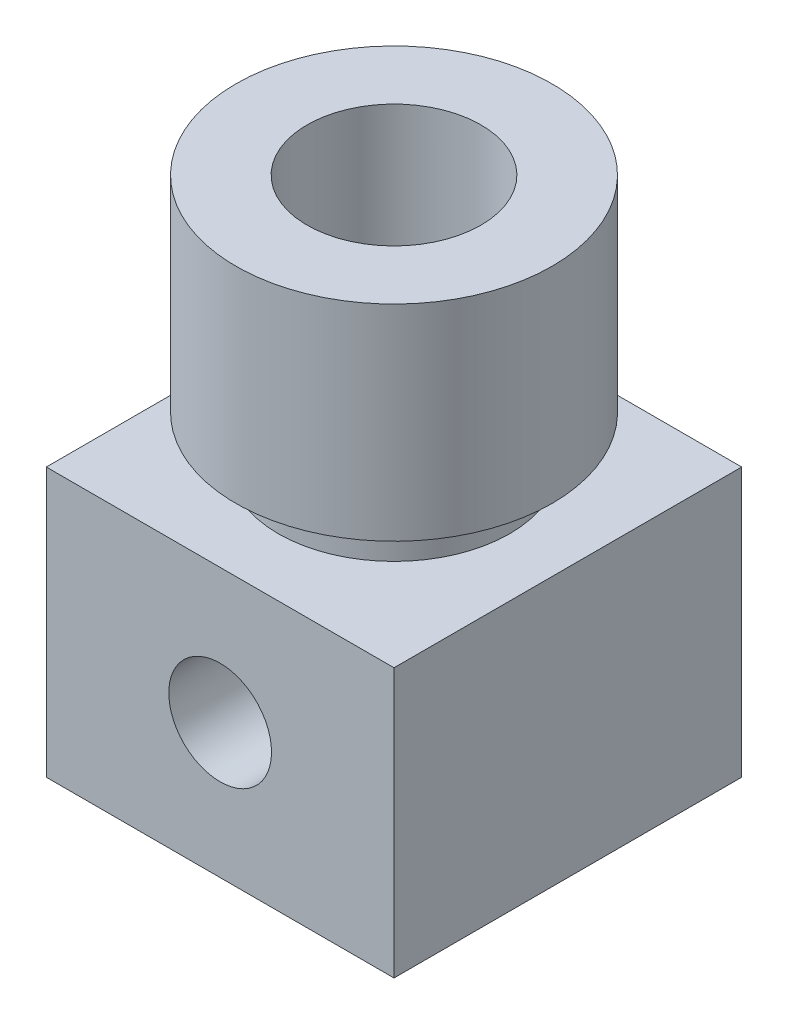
ISO-10303-21;
HEADER;
FILE_DESCRIPTION(('STEP AP214'),'2;1');
FILE_NAME('part.step','',(''),(''),'','','');
FILE_SCHEMA(('AUTOMOTIVE_DESIGN { 1 0 10303 214 1 1 1 1 }'));
ENDSEC;
DATA;
#1=APPLICATION_CONTEXT('core data for automotive mechanical design processes');
#2=APPLICATION_PROTOCOL_DEFINITION('international standard','automotive_design',2000,#1);
#3=PRODUCT_CONTEXT('',#1,'mechanical');
#4=PRODUCT('Part','Part','',(#3));
#5=PRODUCT_RELATED_PRODUCT_CATEGORY('part','',(#4));
#6=PRODUCT_DEFINITION_FORMATION('','',#4);
#7=PRODUCT_DEFINITION_CONTEXT('part definition',#1,'design');
#8=PRODUCT_DEFINITION('design','',#6,#7);
#9=PRODUCT_DEFINITION_SHAPE('','',#8);
#10=(LENGTH_UNIT() NAMED_UNIT(*) SI_UNIT(.MILLI.,.METRE.));
#11=(NAMED_UNIT(*) PLANE_ANGLE_UNIT() SI_UNIT($,.RADIAN.));
#12=(NAMED_UNIT(*) SI_UNIT($,.STERADIAN.) SOLID_ANGLE_UNIT());
#13=UNCERTAINTY_MEASURE_WITH_UNIT(LENGTH_MEASURE(1.E-05),#10,'distance_accuracy_value','');
#14=(GEOMETRIC_REPRESENTATION_CONTEXT(3) GLOBAL_UNCERTAINTY_ASSIGNED_CONTEXT((#13)) GLOBAL_UNIT_ASSIGNED_CONTEXT((#10,
#11,#12)) REPRESENTATION_CONTEXT('',''));
#15=CARTESIAN_POINT('',(0.,0.,0.));
#16=DIRECTION('',(0.,0.,1.));
#17=DIRECTION('',(1.,0.,0.));
#18=AXIS2_PLACEMENT_3D('',#15,#16,#17);
#19=CARTESIAN_POINT('',(0.,17.,0.));
#20=DIRECTION('',(0.,1.,0.));
#21=DIRECTION('',(0.,0.,1.));
#22=AXIS2_PLACEMENT_3D('',#19,#20,#21);
#23=PLANE('',#22);
#24=DIRECTION('',(0.,0.,1.));
#25=VECTOR('',#24,1.);
#26=CARTESIAN_POINT('',(-11.,17.,11.));
#27=LINE('',#26,#25);
#28=CARTESIAN_POINT('',(-11.,17.,-11.));
#29=VERTEX_POINT('',#28);
#30=CARTESIAN_POINT('',(-11.,17.,11.));
#31=VERTEX_POINT('',#30);
#32=EDGE_CURVE('E90',#29,#31,#27,.T.);
#33=ORIENTED_EDGE('',*,*,#32,.T.);
#34=DIRECTION('',(1.,0.,0.));
#35=VECTOR('',#34,1.);
#36=CARTESIAN_POINT('',(11.,17.,11.));
#37=LINE('',#36,#35);
#38=CARTESIAN_POINT('',(11.,17.,11.));
#39=VERTEX_POINT('',#38);
#40=EDGE_CURVE('E85',#31,#39,#37,.T.);
#41=ORIENTED_EDGE('',*,*,#40,.T.);
#42=DIRECTION('',(0.,0.,-1.));
#43=VECTOR('',#42,1.);
#44=CARTESIAN_POINT('',(11.,17.,11.));
#45=LINE('',#44,#43);
#46=CARTESIAN_POINT('',(11.,17.,-11.));
#47=VERTEX_POINT('',#46);
#48=EDGE_CURVE('E88',#39,#47,#45,.T.);
#49=ORIENTED_EDGE('',*,*,#48,.T.);
#50=DIRECTION('',(-1.,0.,0.));
#51=VECTOR('',#50,1.);
#52=CARTESIAN_POINT('',(11.,17.,-11.));
#53=LINE('',#52,#51);
#54=EDGE_CURVE('E55',#47,#29,#53,.T.);
#55=ORIENTED_EDGE('',*,*,#54,.T.);
#56=EDGE_LOOP('',(#33,#41,#49,#55));
#57=FACE_BOUND('',#56,.T.);
#58=CARTESIAN_POINT('',(0.,17.,0.));
#59=DIRECTION('',(0.,-1.,0.));
#60=DIRECTION('',(1.,0.,0.));
#61=AXIS2_PLACEMENT_3D('',#58,#59,#60);
#62=CIRCLE('',#61,7.31805816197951);
#63=CARTESIAN_POINT('',(7.31805816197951,17.,0.));
#64=VERTEX_POINT('',#63);
#65=EDGE_CURVE('E168',#64,#64,#62,.T.);
#66=ORIENTED_EDGE('',*,*,#65,.T.);
#67=EDGE_LOOP('',(#66));
#68=FACE_BOUND('',#67,.T.);
#69=ADVANCED_FACE('F32',(#57,#68),#23,.T.);
#70=CARTESIAN_POINT('',(0.,0.,0.));
#71=DIRECTION('',(0.,1.,0.));
#72=DIRECTION('',(0.,0.,1.));
#73=AXIS2_PLACEMENT_3D('',#70,#71,#72);
#74=PLANE('',#73);
#75=DIRECTION('',(0.,0.,1.));
#76=VECTOR('',#75,1.);
#77=CARTESIAN_POINT('',(-11.,0.,11.));
#78=LINE('',#77,#76);
#79=CARTESIAN_POINT('',(-11.,0.,-11.));
#80=VERTEX_POINT('',#79);
#81=CARTESIAN_POINT('',(-11.,0.,11.));
#82=VERTEX_POINT('',#81);
#83=EDGE_CURVE('E103',#80,#82,#78,.T.);
#84=ORIENTED_EDGE('',*,*,#83,.F.);
#85=DIRECTION('',(-1.,0.,0.));
#86=VECTOR('',#85,1.);
#87=CARTESIAN_POINT('',(11.,0.,-11.));
#88=LINE('',#87,#86);
#89=CARTESIAN_POINT('',(11.,0.,-11.));
#90=VERTEX_POINT('',#89);
#91=EDGE_CURVE('E78',#90,#80,#88,.T.);
#92=ORIENTED_EDGE('',*,*,#91,.F.);
#93=DIRECTION('',(0.,0.,-1.));
#94=VECTOR('',#93,1.);
#95=CARTESIAN_POINT('',(11.,0.,11.));
#96=LINE('',#95,#94);
#97=CARTESIAN_POINT('',(11.,0.,11.));
#98=VERTEX_POINT('',#97);
#99=EDGE_CURVE('E72',#98,#90,#96,.T.);
#100=ORIENTED_EDGE('',*,*,#99,.F.);
#101=DIRECTION('',(1.,0.,0.));
#102=VECTOR('',#101,1.);
#103=CARTESIAN_POINT('',(11.,0.,11.));
#104=LINE('',#103,#102);
#105=EDGE_CURVE('E94',#82,#98,#104,.T.);
#106=ORIENTED_EDGE('',*,*,#105,.F.);
#107=EDGE_LOOP('',(#84,#92,#100,#106));
#108=FACE_BOUND('',#107,.T.);
#109=CARTESIAN_POINT('',(0.,0.,0.));
#110=DIRECTION('',(0.,1.,0.));
#111=DIRECTION('',(0.,0.,1.));
#112=AXIS2_PLACEMENT_3D('',#109,#110,#111);
#113=CIRCLE('',#112,5.5);
#114=CARTESIAN_POINT('',(0.,0.,5.5));
#115=VERTEX_POINT('',#114);
#116=EDGE_CURVE('E106',#115,#115,#113,.T.);
#117=ORIENTED_EDGE('',*,*,#116,.T.);
#118=EDGE_LOOP('',(#117));
#119=FACE_BOUND('',#118,.T.);
#120=ADVANCED_FACE('F146',(#108,#119),#74,.F.);
#121=CARTESIAN_POINT('',(-11.,17.,11.));
#122=DIRECTION('',(1.,0.,0.));
#123=DIRECTION('',(0.,0.,-1.));
#124=AXIS2_PLACEMENT_3D('',#121,#122,#123);
#125=PLANE('',#124);
#126=ORIENTED_EDGE('',*,*,#83,.T.);
#127=DIRECTION('',(0.,-1.,0.));
#128=VECTOR('',#127,1.);
#129=CARTESIAN_POINT('',(-11.,17.,11.));
#130=LINE('',#129,#128);
#131=EDGE_CURVE('E11',#31,#82,#130,.T.);
#132=ORIENTED_EDGE('',*,*,#131,.F.);
#133=ORIENTED_EDGE('',*,*,#32,.F.);
#134=DIRECTION('',(0.,-1.,0.));
#135=VECTOR('',#134,1.);
#136=CARTESIAN_POINT('',(-11.,17.,-11.));
#137=LINE('',#136,#135);
#138=EDGE_CURVE('E99',#29,#80,#137,.T.);
#139=ORIENTED_EDGE('',*,*,#138,.T.);
#140=EDGE_LOOP('',(#126,#132,#133,#139));
#141=FACE_BOUND('',#140,.T.);
#142=ADVANCED_FACE('F34',(#141),#125,.F.);
#143=CARTESIAN_POINT('',(11.,17.,11.));
#144=DIRECTION('',(0.,0.,-1.));
#145=DIRECTION('',(-1.,0.,0.));
#146=AXIS2_PLACEMENT_3D('',#143,#144,#145);
#147=PLANE('',#146);
#148=CARTESIAN_POINT('',(0.,8.5,11.));
#149=DIRECTION('',(0.,0.,1.));
#150=DIRECTION('',(1.,0.,0.));
#151=AXIS2_PLACEMENT_3D('',#148,#149,#150);
#152=CIRCLE('',#151,3.25);
#153=CARTESIAN_POINT('',(3.25,8.5,11.));
#154=VERTEX_POINT('',#153);
#155=EDGE_CURVE('E166',#154,#154,#152,.T.);
#156=ORIENTED_EDGE('',*,*,#155,.F.);
#157=EDGE_LOOP('',(#156));
#158=FACE_BOUND('',#157,.T.);
#159=ORIENTED_EDGE('',*,*,#105,.T.);
#160=DIRECTION('',(0.,-1.,0.));
#161=VECTOR('',#160,1.);
#162=CARTESIAN_POINT('',(11.,17.,11.));
#163=LINE('',#162,#161);
#164=EDGE_CURVE('E46',#39,#98,#163,.T.);
#165=ORIENTED_EDGE('',*,*,#164,.F.);
#166=ORIENTED_EDGE('',*,*,#40,.F.);
#167=ORIENTED_EDGE('',*,*,#131,.T.);
#168=EDGE_LOOP('',(#159,#165,#166,#167));
#169=FACE_BOUND('',#168,.T.);
#170=ADVANCED_FACE('F93',(#158,#169),#147,.F.);
#171=CARTESIAN_POINT('',(11.,17.,11.));
#172=DIRECTION('',(-1.,0.,0.));
#173=DIRECTION('',(0.,0.,1.));
#174=AXIS2_PLACEMENT_3D('',#171,#172,#173);
#175=PLANE('',#174);
#176=ORIENTED_EDGE('',*,*,#99,.T.);
#177=DIRECTION('',(0.,-1.,0.));
#178=VECTOR('',#177,1.);
#179=CARTESIAN_POINT('',(11.,17.,-11.));
#180=LINE('',#179,#178);
#181=EDGE_CURVE('E95',#47,#90,#180,.T.);
#182=ORIENTED_EDGE('',*,*,#181,.F.);
#183=ORIENTED_EDGE('',*,*,#48,.F.);
#184=ORIENTED_EDGE('',*,*,#164,.T.);
#185=EDGE_LOOP('',(#176,#182,#183,#184));
#186=FACE_BOUND('',#185,.T.);
#187=ADVANCED_FACE('F97',(#186),#175,.F.);
#188=CARTESIAN_POINT('',(11.,17.,-11.));
#189=DIRECTION('',(0.,0.,1.));
#190=DIRECTION('',(1.,0.,0.));
#191=AXIS2_PLACEMENT_3D('',#188,#189,#190);
#192=PLANE('',#191);
#193=CARTESIAN_POINT('',(0.,8.5,-11.));
#194=DIRECTION('',(0.,0.,1.));
#195=DIRECTION('',(1.,0.,0.));
#196=AXIS2_PLACEMENT_3D('',#193,#194,#195);
#197=CIRCLE('',#196,3.25);
#198=CARTESIAN_POINT('',(3.25,8.5,-11.));
#199=VERTEX_POINT('',#198);
#200=EDGE_CURVE('E115',#199,#199,#197,.T.);
#201=ORIENTED_EDGE('',*,*,#200,.T.);
#202=EDGE_LOOP('',(#201));
#203=FACE_BOUND('',#202,.T.);
#204=ORIENTED_EDGE('',*,*,#91,.T.);
#205=ORIENTED_EDGE('',*,*,#138,.F.);
#206=ORIENTED_EDGE('',*,*,#54,.F.);
#207=ORIENTED_EDGE('',*,*,#181,.T.);
#208=EDGE_LOOP('',(#204,#205,#206,#207));
#209=FACE_BOUND('',#208,.T.);
#210=ADVANCED_FACE('F153',(#203,#209),#192,.F.);
#211=CARTESIAN_POINT('',(0.,17.,0.));
#212=DIRECTION('',(0.,-1.,0.));
#213=DIRECTION('',(0.,0.,-1.));
#214=AXIS2_PLACEMENT_3D('',#211,#212,#213);
#215=CYLINDRICAL_SURFACE('',#214,5.5);
#216=CARTESIAN_POINT('',(0.,11.75,-5.5));
#217=CARTESIAN_POINT('',(-0.0833686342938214,11.7499993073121,-5.49999936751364));
#218=CARTESIAN_POINT('',(-0.166764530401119,11.7467867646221,-5.49809935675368));
#219=CARTESIAN_POINT('',(-0.33292922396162,11.7339775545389,-5.49054506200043));
#220=CARTESIAN_POINT('',(-0.415697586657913,11.7243768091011,-5.48488837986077));
#221=CARTESIAN_POINT('',(-0.580109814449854,11.6988908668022,-5.46994469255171));
#222=CARTESIAN_POINT('',(-0.661751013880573,11.6829927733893,-5.46065023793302));
#223=CARTESIAN_POINT('',(-0.823156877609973,11.6451229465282,-5.43866389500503));
#224=CARTESIAN_POINT('',(-0.902920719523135,11.6231486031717,-5.42597054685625));
#225=CARTESIAN_POINT('',(-1.13773523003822,11.5487476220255,-5.3833710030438));
#226=CARTESIAN_POINT('',(-1.28931583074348,11.4876830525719,-5.34884832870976));
#227=CARTESIAN_POINT('',(-1.57953818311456,11.3449558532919,-5.27045845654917));
#228=CARTESIAN_POINT('',(-1.71818379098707,11.2632993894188,-5.22659405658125));
#229=CARTESIAN_POINT('',(-1.99051108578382,11.0748393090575,-5.12935536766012));
#230=CARTESIAN_POINT('',(-2.12303609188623,10.9666067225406,-5.07551406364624));
#231=CARTESIAN_POINT('',(-2.36917785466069,10.7312666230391,-4.96540292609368));
#232=CARTESIAN_POINT('',(-2.48277043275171,10.6041353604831,-4.90913010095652));
#233=CARTESIAN_POINT('',(-2.70142042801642,10.3169069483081,-4.7926403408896));
#234=CARTESIAN_POINT('',(-2.8038858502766,10.154689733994,-4.7327423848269));
#235=CARTESIAN_POINT('',(-2.9796948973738,9.81182238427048,-4.62408365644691));
#236=CARTESIAN_POINT('',(-3.05308492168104,9.63120220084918,-4.57530519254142));
#237=CARTESIAN_POINT('',(-3.15356876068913,9.3000074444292,-4.5064184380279));
#238=CARTESIAN_POINT('',(-3.18748949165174,9.1523481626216,-4.48226631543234));
#239=CARTESIAN_POINT('',(-3.23442018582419,8.85217970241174,-4.44852737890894));
#240=CARTESIAN_POINT('',(-3.24745494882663,8.69967649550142,-4.43892329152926));
#241=CARTESIAN_POINT('',(-3.25187121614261,8.39391559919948,-4.43568990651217));
#242=CARTESIAN_POINT('',(-3.24321470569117,8.24065705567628,-4.44208865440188));
#243=CARTESIAN_POINT('',(-3.20470874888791,7.93819547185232,-4.46994159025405));
#244=CARTESIAN_POINT('',(-3.17484378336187,7.78899548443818,-4.49140680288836));
#245=CARTESIAN_POINT('',(-3.09586588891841,7.49980557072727,-4.54619249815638));
#246=CARTESIAN_POINT('',(-3.04694420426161,7.35973979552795,-4.57939489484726));
#247=CARTESIAN_POINT('',(-2.93161593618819,7.08941354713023,-4.6540670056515));
#248=CARTESIAN_POINT('',(-2.86520285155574,6.95915674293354,-4.69553979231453));
#249=CARTESIAN_POINT('',(-2.70372507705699,6.68858270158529,-4.79062113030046));
#250=CARTESIAN_POINT('',(-2.6057073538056,6.55032866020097,-4.8450936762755));
#251=CARTESIAN_POINT('',(-2.38970593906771,6.29084384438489,-4.95520459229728));
#252=CARTESIAN_POINT('',(-2.27170377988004,6.1696290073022,-5.01084399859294));
#253=CARTESIAN_POINT('',(-2.00053312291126,5.9315487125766,-5.12563927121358));
#254=CARTESIAN_POINT('',(-1.84478359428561,5.81732706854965,-5.18430284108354));
#255=CARTESIAN_POINT('',(-1.59598018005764,5.66719851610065,-5.26407557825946));
#256=CARTESIAN_POINT('',(-1.51047637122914,5.62067442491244,-5.28930500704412));
#257=CARTESIAN_POINT('',(-1.33488500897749,5.53519016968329,-5.33632055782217));
#258=CARTESIAN_POINT('',(-1.24480030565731,5.49622537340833,-5.3581087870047));
#259=CARTESIAN_POINT('',(-1.06665933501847,5.42864544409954,-5.3962945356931));
#260=CARTESIAN_POINT('',(-0.978850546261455,5.3995229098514,-5.41295005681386));
#261=CARTESIAN_POINT('',(-0.800477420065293,5.34875796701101,-5.44218660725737));
#262=CARTESIAN_POINT('',(-0.709914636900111,5.32711142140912,-5.45476988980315));
#263=CARTESIAN_POINT('',(-0.526831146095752,5.29163009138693,-5.47548444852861));
#264=CARTESIAN_POINT('',(-0.434311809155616,5.27779001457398,-5.4836187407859));
#265=CARTESIAN_POINT('',(-0.248138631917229,5.25813531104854,-5.49519091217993));
#266=CARTESIAN_POINT('',(-0.154484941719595,5.2523196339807,-5.49862940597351));
#267=CARTESIAN_POINT('',(0.0206896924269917,5.24904580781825,-5.50056379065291));
#268=CARTESIAN_POINT('',(0.102186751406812,5.25058928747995,-5.49965012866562));
#269=CARTESIAN_POINT('',(0.264724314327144,5.25977464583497,-5.49422890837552));
#270=CARTESIAN_POINT('',(0.345764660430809,5.26741851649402,-5.48972017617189));
#271=CARTESIAN_POINT('',(0.587212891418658,5.29938215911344,-5.4709340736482));
#272=CARTESIAN_POINT('',(0.746132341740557,5.33273082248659,-5.4513984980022));
#273=CARTESIAN_POINT('',(1.0522555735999,5.42100565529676,-5.40059701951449));
#274=CARTESIAN_POINT('',(1.19962749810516,5.47549789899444,-5.36956755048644));
#275=CARTESIAN_POINT('',(1.48317090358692,5.60397908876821,-5.29826225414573));
#276=CARTESIAN_POINT('',(1.61934002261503,5.67797213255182,-5.25798448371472));
#277=CARTESIAN_POINT('',(1.89190341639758,5.85197952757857,-5.16657175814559));
#278=CARTESIAN_POINT('',(2.02684330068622,5.95390167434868,-5.11474286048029));
#279=CARTESIAN_POINT('',(2.27874243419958,6.17660845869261,-5.00760526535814));
#280=CARTESIAN_POINT('',(2.39568038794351,6.29741510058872,-4.95229255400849));
#281=CARTESIAN_POINT('',(2.62319164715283,6.57204454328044,-4.83602405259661));
#282=CARTESIAN_POINT('',(2.73116031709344,6.72810529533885,-4.77522298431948));
#283=CARTESIAN_POINT('',(2.91930962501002,7.05907823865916,-4.6625833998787));
#284=CARTESIAN_POINT('',(2.99952244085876,7.23396829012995,-4.61073454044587));
#285=CARTESIAN_POINT('',(3.11464115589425,7.5595060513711,-4.53351350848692));
#286=CARTESIAN_POINT('',(3.15559182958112,7.70722614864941,-4.50484109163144));
#287=CARTESIAN_POINT('',(3.21635056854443,8.00889292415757,-4.46167160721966));
#288=CARTESIAN_POINT('',(3.23618633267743,8.16283116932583,-4.4471559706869));
#289=CARTESIAN_POINT('',(3.25361282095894,8.47315355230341,-4.43442649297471));
#290=CARTESIAN_POINT('',(3.25113345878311,8.6295438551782,-4.43626401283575));
#291=CARTESIAN_POINT('',(3.22392175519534,8.93936739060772,-4.45607313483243));
#292=CARTESIAN_POINT('',(3.19917638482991,9.09279883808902,-4.47405418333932));
#293=CARTESIAN_POINT('',(3.13019310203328,9.38676619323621,-4.52256116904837));
#294=CARTESIAN_POINT('',(3.08672404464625,9.52757011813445,-4.55258937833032));
#295=CARTESIAN_POINT('',(2.98221708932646,9.80007966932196,-4.62172005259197));
#296=CARTESIAN_POINT('',(2.92117259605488,9.93178185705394,-4.66082592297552));
#297=CARTESIAN_POINT('',(2.77237395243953,10.2041428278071,-4.75106422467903));
#298=CARTESIAN_POINT('',(2.68194868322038,10.3430350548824,-4.80312127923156));
#299=CARTESIAN_POINT('',(2.48165486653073,10.6050275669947,-4.9096125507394));
#300=CARTESIAN_POINT('',(2.37177063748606,10.7281149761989,-4.96404865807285));
#301=CARTESIAN_POINT('',(2.11601882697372,10.9740484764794,-5.07886457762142));
#302=CARTESIAN_POINT('',(1.96722437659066,11.0940666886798,-5.13890491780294));
#303=CARTESIAN_POINT('',(1.72834160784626,11.2540074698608,-5.22206900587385));
#304=CARTESIAN_POINT('',(1.64602558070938,11.304005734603,-5.24865975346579));
#305=CARTESIAN_POINT('',(1.47658080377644,11.3968125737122,-5.29882001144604));
#306=CARTESIAN_POINT('',(1.38945486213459,11.4396252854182,-5.32239125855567));
#307=CARTESIAN_POINT('',(1.2144759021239,11.5160072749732,-5.36496376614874));
#308=CARTESIAN_POINT('',(1.12678839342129,11.5498755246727,-5.3841090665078));
#309=CARTESIAN_POINT('',(0.948145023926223,11.6100474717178,-5.41842079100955));
#310=CARTESIAN_POINT('',(0.857191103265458,11.6363555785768,-5.43358953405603));
#311=CARTESIAN_POINT('',(0.673012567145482,11.6809600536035,-5.45945764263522));
#312=CARTESIAN_POINT('',(0.57979560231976,11.6992802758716,-5.47017031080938));
#313=CARTESIAN_POINT('',(0.391751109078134,11.727701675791,-5.48684100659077));
#314=CARTESIAN_POINT('',(0.296925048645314,11.7378099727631,-5.49280315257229));
#315=CARTESIAN_POINT('',(0.168214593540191,11.7458185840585,-5.49753007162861));
#316=CARTESIAN_POINT('',(0.134599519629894,11.7473859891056,-5.49845570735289));
#317=CARTESIAN_POINT('',(0.0673244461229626,11.7494768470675,-5.49969080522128));
#318=CARTESIAN_POINT('',(0.0336644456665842,11.750000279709,-5.50000025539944));
#319=CARTESIAN_POINT('',(0.,11.75,-5.5));
#320=B_SPLINE_CURVE_WITH_KNOTS('',3,(#216,#217,#218,#219,#220,#221,#222,#223,#224,#225,#226,
#227,#228,#229,#230,#231,#232,#233,#234,#235,#236,#237,#238,#239,#240,#241,#242,#243,#244,#245,
#246,#247,#248,#249,#250,#251,#252,#253,#254,#255,#256,#257,#258,#259,#260,#261,#262,#263,#264,
#265,#266,#267,#268,#269,#270,#271,#272,#273,#274,#275,#276,#277,#278,#279,#280,#281,#282,#283,
#284,#285,#286,#287,#288,#289,#290,#291,#292,#293,#294,#295,#296,#297,#298,#299,#300,#301,#302,
#303,#304,#305,#306,#307,#308,#309,#310,#311,#312,#313,#314,#315,#316,#317,#318,#319),
.UNSPECIFIED.,.T.,.F.,(4,2,2,2,2,2,2,2,2,2,2,2,2,2,2,2,2,2,2,2,2,2,2,2,2,2,2,2,2,2,2,2,2,2,2,2,
2,2,2,2,2,2,2,2,2,2,2,2,2,2,2,4),(0.,0.2500697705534,0.500299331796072,0.751044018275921,
1.00189657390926,1.50056846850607,1.99909121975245,2.53509028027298,3.07176870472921,
3.67182350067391,4.27091681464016,4.72920943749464,5.18695748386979,5.64550831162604,
6.10439502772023,6.5587905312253,7.01335516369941,7.54531582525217,8.07777078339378,
8.67988699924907,8.98120077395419,9.28232932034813,9.56392439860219,9.84536339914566,
10.1266113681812,10.4078225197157,10.6520575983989,10.8963724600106,11.3844563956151,
11.8630123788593,12.3416690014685,12.8701910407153,13.3993335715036,13.9943494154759,
14.5886731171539,15.0545732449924,15.5198614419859,15.9866115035,16.4536348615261,
16.9030773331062,17.3526886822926,17.8718581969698,18.3914480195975,18.9892862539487,
19.2886921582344,19.5879250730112,19.8753048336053,20.1625166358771,20.4488647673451,
20.7349643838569,20.8359411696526,20.9369199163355),.UNSPECIFIED.);
#321=CARTESIAN_POINT('',(0.,11.75,-5.5));
#322=VERTEX_POINT('',#321);
#323=EDGE_CURVE('E36',#322,#322,#320,.T.);
#324=ORIENTED_EDGE('',*,*,#323,.F.);
#325=EDGE_LOOP('',(#324));
#326=FACE_BOUND('',#325,.T.);
#327=CARTESIAN_POINT('',(3.25,8.5,4.43705983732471));
#328=CARTESIAN_POINT('',(3.25000022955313,8.41795178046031,4.43705951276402));
#329=CARTESIAN_POINT('',(3.24688827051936,8.33590618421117,4.4393440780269));
#330=CARTESIAN_POINT('',(3.23449552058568,8.17250033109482,4.44838139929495));
#331=CARTESIAN_POINT('',(3.22521221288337,8.09114036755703,4.45513597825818));
#332=CARTESIAN_POINT('',(3.20062387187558,7.9297627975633,4.47283302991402));
#333=CARTESIAN_POINT('',(3.18531608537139,7.84974582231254,4.48377741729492));
#334=CARTESIAN_POINT('',(3.14891190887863,7.69163986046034,4.50941754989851));
#335=CARTESIAN_POINT('',(3.12781279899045,7.61355179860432,4.52411505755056));
#336=CARTESIAN_POINT('',(3.05657743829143,7.38405975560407,4.57281516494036));
#337=CARTESIAN_POINT('',(2.99829635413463,7.23611167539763,4.6115842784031));
#338=CARTESIAN_POINT('',(2.86214881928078,6.95227270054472,4.69729225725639));
#339=CARTESIAN_POINT('',(2.78427622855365,6.81638560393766,4.74423368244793));
#340=CARTESIAN_POINT('',(2.60038632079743,6.54277098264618,4.84771826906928));
#341=CARTESIAN_POINT('',(2.49213039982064,6.40672403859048,4.90474054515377));
#342=CARTESIAN_POINT('',(2.25518739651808,6.15334647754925,5.01811054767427));
#343=CARTESIAN_POINT('',(2.12648573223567,6.03602933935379,5.07445776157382));
#344=CARTESIAN_POINT('',(1.83593375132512,5.81134639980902,5.18709391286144));
#345=CARTESIAN_POINT('',(1.67203012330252,5.70627315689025,5.24277120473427));
#346=CARTESIAN_POINT('',(1.41198810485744,5.57111414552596,5.316434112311));
#347=CARTESIAN_POINT('',(1.32291300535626,5.5297935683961,5.33935185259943));
#348=CARTESIAN_POINT('',(1.14060769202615,5.45513654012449,5.38123888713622));
#349=CARTESIAN_POINT('',(1.0473802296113,5.42179489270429,5.40021075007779));
#350=CARTESIAN_POINT('',(0.866333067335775,5.36629837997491,5.43204570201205));
#351=CARTESIAN_POINT('',(0.778813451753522,5.34339290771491,5.44531209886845));
#352=CARTESIAN_POINT('',(0.601703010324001,5.30490068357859,5.46771563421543));
#353=CARTESIAN_POINT('',(0.512113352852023,5.28930990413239,5.47685504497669));
#354=CARTESIAN_POINT('',(0.331643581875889,5.26568627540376,5.49073695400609));
#355=CARTESIAN_POINT('',(0.240764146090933,5.25764959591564,5.49548168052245));
#356=CARTESIAN_POINT('',(0.0585588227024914,5.24924592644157,5.50044509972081));
#357=CARTESIAN_POINT('',(-0.0327670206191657,5.24887819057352,5.50066423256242));
#358=CARTESIAN_POINT('',(-0.284150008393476,5.25848959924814,5.49498196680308));
#359=CARTESIAN_POINT('',(-0.443886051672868,5.27651465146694,5.48432022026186));
#360=CARTESIAN_POINT('',(-0.757480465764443,5.33547169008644,5.44987927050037));
#361=CARTESIAN_POINT('',(-0.911338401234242,5.37640536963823,5.42609909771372));
#362=CARTESIAN_POINT('',(-1.21057063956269,5.47969495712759,5.36730180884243));
#363=CARTESIAN_POINT('',(-1.35587957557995,5.54219575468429,5.33220879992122));
#364=CARTESIAN_POINT('',(-1.63413938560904,5.6863411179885,5.25362072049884));
#365=CARTESIAN_POINT('',(-1.76708689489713,5.76799087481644,5.21012337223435));
#366=CARTESIAN_POINT('',(-2.03359625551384,5.95895124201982,5.11242732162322));
#367=CARTESIAN_POINT('',(-2.16539527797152,6.07038458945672,5.05757175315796));
#368=CARTESIAN_POINT('',(-2.4095361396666,6.31225657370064,4.94592776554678));
#369=CARTESIAN_POINT('',(-2.52185204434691,6.4427201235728,4.88913688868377));
#370=CARTESIAN_POINT('',(-2.73636801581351,6.73609062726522,4.77270972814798));
#371=CARTESIAN_POINT('',(-2.83607409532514,6.90099007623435,4.71345378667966));
#372=CARTESIAN_POINT('',(-3.00576993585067,7.24894696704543,4.60710725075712));
#373=CARTESIAN_POINT('',(-3.07581398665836,7.43197047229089,4.55999449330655));
#374=CARTESIAN_POINT('',(-3.16945279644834,7.76555743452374,4.49521848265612));
#375=CARTESIAN_POINT('',(-3.20018350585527,7.91326977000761,4.47318900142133));
#376=CARTESIAN_POINT('',(-3.24081304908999,8.21290902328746,4.44384880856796));
#377=CARTESIAN_POINT('',(-3.25073468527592,8.36483114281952,4.43652198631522));
#378=CARTESIAN_POINT('',(-3.24917901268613,8.66866457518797,4.43766090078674));
#379=CARTESIAN_POINT('',(-3.23767801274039,8.82057569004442,4.44614412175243));
#380=CARTESIAN_POINT('',(-3.19393012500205,9.11985868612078,4.47766766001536));
#381=CARTESIAN_POINT('',(-3.16166721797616,9.26722697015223,4.50071921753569));
#382=CARTESIAN_POINT('',(-3.07784408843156,9.55444783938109,4.55844732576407));
#383=CARTESIAN_POINT('',(-3.02621590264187,9.69427194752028,4.59316477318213));
#384=CARTESIAN_POINT('',(-2.90546701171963,9.96376075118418,4.67048125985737));
#385=CARTESIAN_POINT('',(-2.83633953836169,10.0934214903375,4.7130833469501));
#386=CARTESIAN_POINT('',(-2.66849663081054,10.3630848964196,4.81041473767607));
#387=CARTESIAN_POINT('',(-2.56671477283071,10.5008897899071,4.86595866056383));
#388=CARTESIAN_POINT('',(-2.3429395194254,10.7588396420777,4.97758210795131));
#389=CARTESIAN_POINT('',(-2.22092754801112,10.8789681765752,5.03366207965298));
#390=CARTESIAN_POINT('',(-1.94244222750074,11.1127000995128,5.14801836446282));
#391=CARTESIAN_POINT('',(-1.78359092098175,11.2237935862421,5.20575163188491));
#392=CARTESIAN_POINT('',(-1.53044652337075,11.36874958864,5.28352030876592));
#393=CARTESIAN_POINT('',(-1.44355215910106,11.413466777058,5.30797876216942));
#394=CARTESIAN_POINT('',(-1.26531823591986,11.4951727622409,5.35326043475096));
#395=CARTESIAN_POINT('',(-1.17398151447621,11.532166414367,5.37408593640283));
#396=CARTESIAN_POINT('',(-0.994592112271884,11.5954223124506,5.41003846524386));
#397=CARTESIAN_POINT('',(-0.906812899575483,11.6222842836,5.42547720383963));
#398=CARTESIAN_POINT('',(-0.728748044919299,11.6685773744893,5.45224959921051));
#399=CARTESIAN_POINT('',(-0.638463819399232,11.6880126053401,5.46358552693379));
#400=CARTESIAN_POINT('',(-0.456176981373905,11.7191522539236,5.48181357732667));
#401=CARTESIAN_POINT('',(-0.364175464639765,11.7308614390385,5.48870844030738));
#402=CARTESIAN_POINT('',(-0.17931203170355,11.7463772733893,5.49785705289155));
#403=CARTESIAN_POINT('',(-0.0864502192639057,11.7501848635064,5.50011135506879));
#404=CARTESIAN_POINT('',(0.168283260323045,11.7496604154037,5.49979564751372));
#405=CARTESIAN_POINT('',(0.33023032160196,11.737191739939,5.49240443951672));
#406=CARTESIAN_POINT('',(0.649167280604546,11.6885985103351,5.46390791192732));
#407=CARTESIAN_POINT('',(0.806157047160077,11.6524733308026,5.44280222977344));
#408=CARTESIAN_POINT('',(1.10968893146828,11.5587694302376,5.38907371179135));
#409=CARTESIAN_POINT('',(1.25631959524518,11.5014081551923,5.35656778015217));
#410=CARTESIAN_POINT('',(1.53794694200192,11.3673288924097,5.28260862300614));
#411=CARTESIAN_POINT('',(1.67294084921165,11.2906063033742,5.24115327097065));
#412=CARTESIAN_POINT('',(1.9433744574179,11.1105555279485,5.1474213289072));
#413=CARTESIAN_POINT('',(2.077246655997,11.0052347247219,5.09445701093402));
#414=CARTESIAN_POINT('',(2.32648033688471,10.775684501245,4.98558210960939));
#415=CARTESIAN_POINT('',(2.44182016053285,10.6514332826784,4.92966817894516));
#416=CARTESIAN_POINT('',(2.66484986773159,10.3700517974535,4.81313009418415));
#417=CARTESIAN_POINT('',(2.76995991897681,10.2107651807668,4.75274610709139));
#418=CARTESIAN_POINT('',(2.95176891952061,9.87335858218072,4.64203004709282));
#419=CARTESIAN_POINT('',(3.0284942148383,9.69525626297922,4.59168867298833));
#420=CARTESIAN_POINT('',(3.11533599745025,9.4297048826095,4.53273428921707));
#421=CARTESIAN_POINT('',(3.13856762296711,9.3480352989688,4.51663473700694));
#422=CARTESIAN_POINT('',(3.17867203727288,9.18248196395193,4.48850174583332));
#423=CARTESIAN_POINT('',(3.19554855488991,9.09859954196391,4.47646592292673));
#424=CARTESIAN_POINT('',(3.22265447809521,8.92934492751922,4.45699196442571));
#425=CARTESIAN_POINT('',(3.232891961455,8.84397467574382,4.44954824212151));
#426=CARTESIAN_POINT('',(3.24656443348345,8.6724019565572,4.43958247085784));
#427=CARTESIAN_POINT('',(3.24999975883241,8.58619953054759,4.43706017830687));
#428=CARTESIAN_POINT('',(3.25,8.5,4.43705983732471));
#429=B_SPLINE_CURVE_WITH_KNOTS('',3,(#327,#328,#329,#330,#331,#332,#333,#334,#335,#336,#337,
#338,#339,#340,#341,#342,#343,#344,#345,#346,#347,#348,#349,#350,#351,#352,#353,#354,#355,#356,
#357,#358,#359,#360,#361,#362,#363,#364,#365,#366,#367,#368,#369,#370,#371,#372,#373,#374,#375,
#376,#377,#378,#379,#380,#381,#382,#383,#384,#385,#386,#387,#388,#389,#390,#391,#392,#393,#394,
#395,#396,#397,#398,#399,#400,#401,#402,#403,#404,#405,#406,#407,#408,#409,#410,#411,#412,#413,
#414,#415,#416,#417,#418,#419,#420,#421,#422,#423,#424,#425,#426,#427,#428),.UNSPECIFIED.,.T.,
.F.,(4,2,2,2,2,2,2,2,2,2,2,2,2,2,2,2,2,2,2,2,2,2,2,2,2,2,2,2,2,2,2,2,2,2,2,2,2,2,2,2,2,2,2,2,2,
2,2,2,2,2,4),(0.,0.246050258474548,0.492200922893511,0.738464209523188,0.984843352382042,
1.47362747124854,1.96256496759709,2.50928854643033,3.05640381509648,3.66023917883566,
3.96234537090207,4.26425427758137,4.53816979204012,4.81193430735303,5.08555993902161,
5.35915895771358,5.83993738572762,6.32075135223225,6.80486046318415,7.28910096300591,
7.83023193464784,8.37207778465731,8.97387173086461,9.57455941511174,10.0300106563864,
10.4849625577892,10.9404178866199,11.396225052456,11.8536470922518,12.3112463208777,
12.8494035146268,13.3880576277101,13.9913050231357,14.2931527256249,14.5948100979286,
14.8736702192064,15.1523757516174,15.4309091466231,15.7094093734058,16.1945711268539,
16.6797457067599,17.1600838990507,17.6405363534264,18.1735604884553,18.7072031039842,
19.3048971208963,19.9020349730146,20.1610148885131,20.4198426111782,20.6783548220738,
20.9368542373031),.UNSPECIFIED.);
#430=CARTESIAN_POINT('',(3.25,8.5,4.43705983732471));
#431=VERTEX_POINT('',#430);
#432=EDGE_CURVE('E111',#431,#431,#429,.T.);
#433=ORIENTED_EDGE('',*,*,#432,.F.);
#434=EDGE_LOOP('',(#433));
#435=FACE_BOUND('',#434,.T.);
#436=ORIENTED_EDGE('',*,*,#116,.F.);
#437=EDGE_LOOP('',(#436));
#438=FACE_BOUND('',#437,.T.);
#439=CARTESIAN_POINT('',(0.,33.,0.));
#440=DIRECTION('',(0.,-1.,0.));
#441=DIRECTION('',(1.,0.,0.));
#442=AXIS2_PLACEMENT_3D('',#439,#440,#441);
#443=CIRCLE('',#442,5.5);
#444=CARTESIAN_POINT('',(5.5,33.,0.));
#445=VERTEX_POINT('',#444);
#446=EDGE_CURVE('E191',#445,#445,#443,.T.);
#447=ORIENTED_EDGE('',*,*,#446,.F.);
#448=EDGE_LOOP('',(#447));
#449=FACE_BOUND('',#448,.T.);
#450=ADVANCED_FACE('F116',(#326,#435,#438,#449),#215,.F.);
#451=CARTESIAN_POINT('',(0.,8.5,-11.));
#452=DIRECTION('',(0.,0.,1.));
#453=DIRECTION('',(1.,0.,0.));
#454=AXIS2_PLACEMENT_3D('',#451,#452,#453);
#455=CYLINDRICAL_SURFACE('',#454,3.25);
#456=ORIENTED_EDGE('',*,*,#432,.T.);
#457=EDGE_LOOP('',(#456));
#458=FACE_BOUND('',#457,.T.);
#459=ORIENTED_EDGE('',*,*,#155,.T.);
#460=EDGE_LOOP('',(#459));
#461=FACE_BOUND('',#460,.T.);
#462=ADVANCED_FACE('F119',(#458,#461),#455,.F.);
#463=ORIENTED_EDGE('',*,*,#323,.T.);
#464=EDGE_LOOP('',(#463));
#465=FACE_BOUND('',#464,.T.);
#466=ORIENTED_EDGE('',*,*,#200,.F.);
#467=EDGE_LOOP('',(#466));
#468=FACE_BOUND('',#467,.T.);
#469=ADVANCED_FACE('F123',(#465,#468),#455,.F.);
#470=CARTESIAN_POINT('',(0.,14.6310593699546,0.));
#471=DIRECTION('',(0.,-1.,0.));
#472=DIRECTION('',(1.,0.,0.));
#473=AXIS2_PLACEMENT_3D('',#470,#471,#472);
#474=CYLINDRICAL_SURFACE('',#473,7.31805816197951);
#475=ORIENTED_EDGE('',*,*,#65,.F.);
#476=EDGE_LOOP('',(#475));
#477=FACE_BOUND('',#476,.T.);
#478=CARTESIAN_POINT('',(0.,20.,0.));
#479=DIRECTION('',(0.,-1.,0.));
#480=DIRECTION('',(1.,0.,0.));
#481=AXIS2_PLACEMENT_3D('',#478,#479,#480);
#482=CIRCLE('',#481,7.31805816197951);
#483=CARTESIAN_POINT('',(7.31805816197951,20.,0.));
#484=VERTEX_POINT('',#483);
#485=EDGE_CURVE('E173',#484,#484,#482,.T.);
#486=ORIENTED_EDGE('',*,*,#485,.T.);
#487=EDGE_LOOP('',(#486));
#488=FACE_BOUND('',#487,.T.);
#489=ADVANCED_FACE('F125',(#477,#488),#474,.T.);
#490=CARTESIAN_POINT('',(-7.31805816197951,20.,0.));
#491=DIRECTION('',(0.,1.,0.));
#492=DIRECTION('',(-1.,0.,0.));
#493=AXIS2_PLACEMENT_3D('',#490,#491,#492);
#494=PLANE('',#493);
#495=ORIENTED_EDGE('',*,*,#485,.F.);
#496=EDGE_LOOP('',(#495));
#497=FACE_BOUND('',#496,.T.);
#498=CARTESIAN_POINT('',(0.,20.,0.));
#499=DIRECTION('',(0.,-1.,0.));
#500=DIRECTION('',(1.,0.,0.));
#501=AXIS2_PLACEMENT_3D('',#498,#499,#500);
#502=CIRCLE('',#501,10.);
#503=CARTESIAN_POINT('',(10.,20.,0.));
#504=VERTEX_POINT('',#503);
#505=EDGE_CURVE('E195',#504,#504,#502,.T.);
#506=ORIENTED_EDGE('',*,*,#505,.T.);
#507=EDGE_LOOP('',(#506));
#508=FACE_BOUND('',#507,.T.);
#509=ADVANCED_FACE('F129',(#497,#508),#494,.F.);
#510=CARTESIAN_POINT('',(0.,14.6310593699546,0.));
#511=DIRECTION('',(0.,-1.,0.));
#512=DIRECTION('',(1.,0.,0.));
#513=AXIS2_PLACEMENT_3D('',#510,#511,#512);
#514=CYLINDRICAL_SURFACE('',#513,10.);
#515=ORIENTED_EDGE('',*,*,#505,.F.);
#516=EDGE_LOOP('',(#515));
#517=FACE_BOUND('',#516,.T.);
#518=CARTESIAN_POINT('',(0.,33.,0.));
#519=DIRECTION('',(0.,-1.,0.));
#520=DIRECTION('',(1.,0.,0.));
#521=AXIS2_PLACEMENT_3D('',#518,#519,#520);
#522=CIRCLE('',#521,10.);
#523=CARTESIAN_POINT('',(10.,33.,0.));
#524=VERTEX_POINT('',#523);
#525=EDGE_CURVE('E192',#524,#524,#522,.T.);
#526=ORIENTED_EDGE('',*,*,#525,.T.);
#527=EDGE_LOOP('',(#526));
#528=FACE_BOUND('',#527,.T.);
#529=ADVANCED_FACE('F133',(#517,#528),#514,.T.);
#530=CARTESIAN_POINT('',(-10.,33.,0.));
#531=DIRECTION('',(0.,-1.,0.));
#532=DIRECTION('',(1.,0.,0.));
#533=AXIS2_PLACEMENT_3D('',#530,#531,#532);
#534=PLANE('',#533);
#535=ORIENTED_EDGE('',*,*,#525,.F.);
#536=EDGE_LOOP('',(#535));
#537=FACE_BOUND('',#536,.T.);
#538=ORIENTED_EDGE('',*,*,#446,.T.);
#539=EDGE_LOOP('',(#538));
#540=FACE_BOUND('',#539,.T.);
#541=ADVANCED_FACE('F137',(#537,#540),#534,.F.);
#542=CLOSED_SHELL('',(#69,#120,#142,#170,#187,#210,#450,#462,#469,#489,#509,#529,#541));
#543=MANIFOLD_SOLID_BREP('B2',#542);
#544=ADVANCED_BREP_SHAPE_REPRESENTATION('',(#18,#543),#14);
#545=SHAPE_DEFINITION_REPRESENTATION(#9,#544);
ENDSEC;
END-ISO-10303-21;
